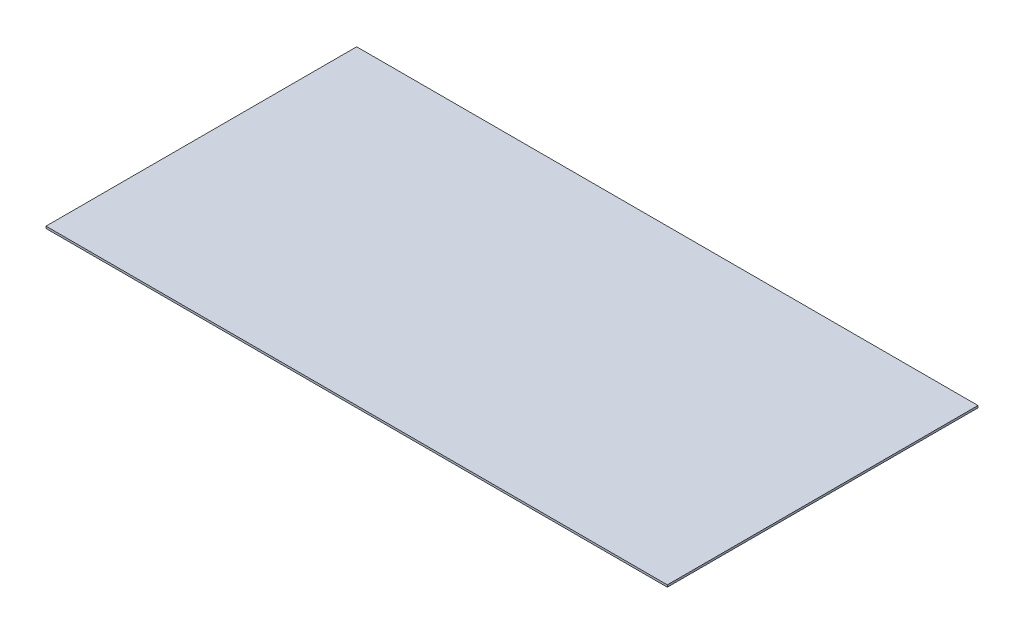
ISO-10303-21;
HEADER;
FILE_DESCRIPTION(('STEP AP214'),'2;1');
FILE_NAME('part.step','',(''),(''),'','','');
FILE_SCHEMA(('AUTOMOTIVE_DESIGN { 1 0 10303 214 1 1 1 1 }'));
ENDSEC;
DATA;
#1=APPLICATION_CONTEXT('core data for automotive mechanical design processes');
#2=APPLICATION_PROTOCOL_DEFINITION('international standard','automotive_design',2000,#1);
#3=PRODUCT_CONTEXT('',#1,'mechanical');
#4=PRODUCT('Part','Part','',(#3));
#5=PRODUCT_RELATED_PRODUCT_CATEGORY('part','',(#4));
#6=PRODUCT_DEFINITION_FORMATION('','',#4);
#7=PRODUCT_DEFINITION_CONTEXT('part definition',#1,'design');
#8=PRODUCT_DEFINITION('design','',#6,#7);
#9=PRODUCT_DEFINITION_SHAPE('','',#8);
#10=(LENGTH_UNIT() NAMED_UNIT(*) SI_UNIT(.MILLI.,.METRE.));
#11=(NAMED_UNIT(*) PLANE_ANGLE_UNIT() SI_UNIT($,.RADIAN.));
#12=(NAMED_UNIT(*) SI_UNIT($,.STERADIAN.) SOLID_ANGLE_UNIT());
#13=UNCERTAINTY_MEASURE_WITH_UNIT(LENGTH_MEASURE(1.E-05),#10,'distance_accuracy_value','');
#14=(GEOMETRIC_REPRESENTATION_CONTEXT(3) GLOBAL_UNCERTAINTY_ASSIGNED_CONTEXT((#13)) GLOBAL_UNIT_ASSIGNED_CONTEXT((#10,
#11,#12)) REPRESENTATION_CONTEXT('',''));
#15=CARTESIAN_POINT('',(0.,0.,0.));
#16=DIRECTION('',(0.,0.,1.));
#17=DIRECTION('',(1.,0.,0.));
#18=AXIS2_PLACEMENT_3D('',#15,#16,#17);
#19=CARTESIAN_POINT('',(1500.,10.,750.));
#20=DIRECTION('',(-1.,0.,0.));
#21=DIRECTION('',(0.,0.,1.));
#22=AXIS2_PLACEMENT_3D('',#19,#20,#21);
#23=PLANE('',#22);
#24=DIRECTION('',(0.,0.,-1.));
#25=VECTOR('',#24,1.);
#26=CARTESIAN_POINT('',(1500.,0.,750.));
#27=LINE('',#26,#25);
#28=CARTESIAN_POINT('',(1500.,0.,750.));
#29=VERTEX_POINT('',#28);
#30=CARTESIAN_POINT('',(1500.,0.,-750.));
#31=VERTEX_POINT('',#30);
#32=EDGE_CURVE('E107',#29,#31,#27,.T.);
#33=ORIENTED_EDGE('',*,*,#32,.T.);
#34=DIRECTION('',(0.,-1.,0.));
#35=VECTOR('',#34,1.);
#36=CARTESIAN_POINT('',(1500.,10.,-750.));
#37=LINE('',#36,#35);
#38=CARTESIAN_POINT('',(1500.,10.,-750.));
#39=VERTEX_POINT('',#38);
#40=EDGE_CURVE('E11',#39,#31,#37,.T.);
#41=ORIENTED_EDGE('',*,*,#40,.F.);
#42=DIRECTION('',(0.,0.,-1.));
#43=VECTOR('',#42,1.);
#44=CARTESIAN_POINT('',(1500.,10.,750.));
#45=LINE('',#44,#43);
#46=CARTESIAN_POINT('',(1500.,10.,750.));
#47=VERTEX_POINT('',#46);
#48=EDGE_CURVE('E91',#47,#39,#45,.T.);
#49=ORIENTED_EDGE('',*,*,#48,.F.);
#50=DIRECTION('',(0.,-1.,0.));
#51=VECTOR('',#50,1.);
#52=CARTESIAN_POINT('',(1500.,10.,750.));
#53=LINE('',#52,#51);
#54=EDGE_CURVE('E103',#47,#29,#53,.T.);
#55=ORIENTED_EDGE('',*,*,#54,.T.);
#56=EDGE_LOOP('',(#33,#41,#49,#55));
#57=FACE_BOUND('',#56,.T.);
#58=ADVANCED_FACE('F39',(#57),#23,.F.);
#59=CARTESIAN_POINT('',(-1500.,10.,-750.));
#60=DIRECTION('',(0.,0.,1.));
#61=DIRECTION('',(1.,0.,0.));
#62=AXIS2_PLACEMENT_3D('',#59,#60,#61);
#63=PLANE('',#62);
#64=DIRECTION('',(-1.,0.,0.));
#65=VECTOR('',#64,1.);
#66=CARTESIAN_POINT('',(-1500.,0.,-750.));
#67=LINE('',#66,#65);
#68=CARTESIAN_POINT('',(-1500.,0.,-750.));
#69=VERTEX_POINT('',#68);
#70=EDGE_CURVE('E96',#31,#69,#67,.T.);
#71=ORIENTED_EDGE('',*,*,#70,.T.);
#72=DIRECTION('',(0.,-1.,0.));
#73=VECTOR('',#72,1.);
#74=CARTESIAN_POINT('',(-1500.,10.,-750.));
#75=LINE('',#74,#73);
#76=CARTESIAN_POINT('',(-1500.,10.,-750.));
#77=VERTEX_POINT('',#76);
#78=EDGE_CURVE('E48',#77,#69,#75,.T.);
#79=ORIENTED_EDGE('',*,*,#78,.F.);
#80=DIRECTION('',(-1.,0.,0.));
#81=VECTOR('',#80,1.);
#82=CARTESIAN_POINT('',(-1500.,10.,-750.));
#83=LINE('',#82,#81);
#84=EDGE_CURVE('E86',#39,#77,#83,.T.);
#85=ORIENTED_EDGE('',*,*,#84,.F.);
#86=ORIENTED_EDGE('',*,*,#40,.T.);
#87=EDGE_LOOP('',(#71,#79,#85,#86));
#88=FACE_BOUND('',#87,.T.);
#89=ADVANCED_FACE('F95',(#88),#63,.F.);
#90=CARTESIAN_POINT('',(-1500.,10.,750.));
#91=DIRECTION('',(1.,0.,0.));
#92=DIRECTION('',(0.,0.,-1.));
#93=AXIS2_PLACEMENT_3D('',#90,#91,#92);
#94=PLANE('',#93);
#95=DIRECTION('',(0.,0.,1.));
#96=VECTOR('',#95,1.);
#97=CARTESIAN_POINT('',(-1500.,0.,750.));
#98=LINE('',#97,#96);
#99=CARTESIAN_POINT('',(-1500.,0.,750.));
#100=VERTEX_POINT('',#99);
#101=EDGE_CURVE('E73',#69,#100,#98,.T.);
#102=ORIENTED_EDGE('',*,*,#101,.T.);
#103=DIRECTION('',(0.,-1.,0.));
#104=VECTOR('',#103,1.);
#105=CARTESIAN_POINT('',(-1500.,10.,750.));
#106=LINE('',#105,#104);
#107=CARTESIAN_POINT('',(-1500.,10.,750.));
#108=VERTEX_POINT('',#107);
#109=EDGE_CURVE('E98',#108,#100,#106,.T.);
#110=ORIENTED_EDGE('',*,*,#109,.F.);
#111=DIRECTION('',(0.,0.,1.));
#112=VECTOR('',#111,1.);
#113=CARTESIAN_POINT('',(-1500.,10.,750.));
#114=LINE('',#113,#112);
#115=EDGE_CURVE('E89',#77,#108,#114,.T.);
#116=ORIENTED_EDGE('',*,*,#115,.F.);
#117=ORIENTED_EDGE('',*,*,#78,.T.);
#118=EDGE_LOOP('',(#102,#110,#116,#117));
#119=FACE_BOUND('',#118,.T.);
#120=ADVANCED_FACE('F99',(#119),#94,.F.);
#121=CARTESIAN_POINT('',(-1500.,10.,750.));
#122=DIRECTION('',(0.,0.,-1.));
#123=DIRECTION('',(-1.,0.,0.));
#124=AXIS2_PLACEMENT_3D('',#121,#122,#123);
#125=PLANE('',#124);
#126=DIRECTION('',(1.,0.,0.));
#127=VECTOR('',#126,1.);
#128=CARTESIAN_POINT('',(-1500.,0.,750.));
#129=LINE('',#128,#127);
#130=EDGE_CURVE('E79',#100,#29,#129,.T.);
#131=ORIENTED_EDGE('',*,*,#130,.T.);
#132=ORIENTED_EDGE('',*,*,#54,.F.);
#133=DIRECTION('',(1.,0.,0.));
#134=VECTOR('',#133,1.);
#135=CARTESIAN_POINT('',(-1500.,10.,750.));
#136=LINE('',#135,#134);
#137=EDGE_CURVE('E56',#108,#47,#136,.T.);
#138=ORIENTED_EDGE('',*,*,#137,.F.);
#139=ORIENTED_EDGE('',*,*,#109,.T.);
#140=EDGE_LOOP('',(#131,#132,#138,#139));
#141=FACE_BOUND('',#140,.T.);
#142=ADVANCED_FACE('F120',(#141),#125,.F.);
#143=CARTESIAN_POINT('',(0.,10.,0.));
#144=DIRECTION('',(0.,-1.,0.));
#145=DIRECTION('',(0.,0.,-1.));
#146=AXIS2_PLACEMENT_3D('',#143,#144,#145);
#147=PLANE('',#146);
#148=ORIENTED_EDGE('',*,*,#48,.T.);
#149=ORIENTED_EDGE('',*,*,#84,.T.);
#150=ORIENTED_EDGE('',*,*,#115,.T.);
#151=ORIENTED_EDGE('',*,*,#137,.T.);
#152=EDGE_LOOP('',(#148,#149,#150,#151));
#153=FACE_BOUND('',#152,.T.);
#154=ADVANCED_FACE('F87',(#153),#147,.F.);
#155=CARTESIAN_POINT('',(0.,0.,0.));
#156=DIRECTION('',(0.,-1.,0.));
#157=DIRECTION('',(0.,0.,-1.));
#158=AXIS2_PLACEMENT_3D('',#155,#156,#157);
#159=PLANE('',#158);
#160=ORIENTED_EDGE('',*,*,#32,.F.);
#161=ORIENTED_EDGE('',*,*,#130,.F.);
#162=ORIENTED_EDGE('',*,*,#101,.F.);
#163=ORIENTED_EDGE('',*,*,#70,.F.);
#164=EDGE_LOOP('',(#160,#161,#162,#163));
#165=FACE_BOUND('',#164,.T.);
#166=ADVANCED_FACE('F123',(#165),#159,.T.);
#167=CLOSED_SHELL('',(#58,#89,#120,#142,#154,#166));
#168=MANIFOLD_SOLID_BREP('B2',#167);
#169=ADVANCED_BREP_SHAPE_REPRESENTATION('',(#18,#168),#14);
#170=SHAPE_DEFINITION_REPRESENTATION(#9,#169);
ENDSEC;
END-ISO-10303-21;
